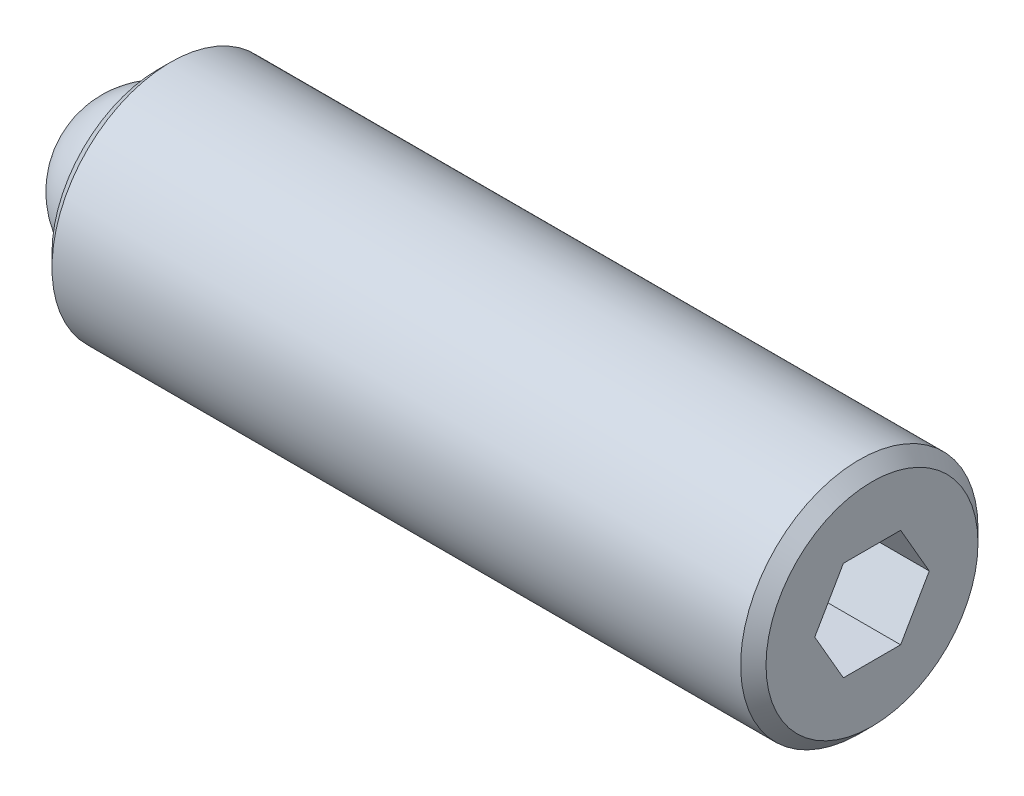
ISO-10303-21;
HEADER;
FILE_DESCRIPTION(('STEP AP214'),'2;1');
FILE_NAME('part.step','',(''),(''),'','','');
FILE_SCHEMA(('AUTOMOTIVE_DESIGN { 1 0 10303 214 1 1 1 1 }'));
ENDSEC;
DATA;
#1=APPLICATION_CONTEXT('core data for automotive mechanical design processes');
#2=APPLICATION_PROTOCOL_DEFINITION('international standard','automotive_design',2000,#1);
#3=PRODUCT_CONTEXT('',#1,'mechanical');
#4=PRODUCT('Part','Part','',(#3));
#5=PRODUCT_RELATED_PRODUCT_CATEGORY('part','',(#4));
#6=PRODUCT_DEFINITION_FORMATION('','',#4);
#7=PRODUCT_DEFINITION_CONTEXT('part definition',#1,'design');
#8=PRODUCT_DEFINITION('design','',#6,#7);
#9=PRODUCT_DEFINITION_SHAPE('','',#8);
#10=(LENGTH_UNIT() NAMED_UNIT(*) SI_UNIT(.MILLI.,.METRE.));
#11=(NAMED_UNIT(*) PLANE_ANGLE_UNIT() SI_UNIT($,.RADIAN.));
#12=(NAMED_UNIT(*) SI_UNIT($,.STERADIAN.) SOLID_ANGLE_UNIT());
#13=UNCERTAINTY_MEASURE_WITH_UNIT(LENGTH_MEASURE(1.E-05),#10,'distance_accuracy_value','');
#14=(GEOMETRIC_REPRESENTATION_CONTEXT(3) GLOBAL_UNCERTAINTY_ASSIGNED_CONTEXT((#13)) GLOBAL_UNIT_ASSIGNED_CONTEXT((#10,
#11,#12)) REPRESENTATION_CONTEXT('',''));
#15=CARTESIAN_POINT('',(0.,0.,0.));
#16=DIRECTION('',(0.,0.,1.));
#17=DIRECTION('',(1.,0.,0.));
#18=AXIS2_PLACEMENT_3D('',#15,#16,#17);
#19=CARTESIAN_POINT('',(0.,0.,0.));
#20=DIRECTION('',(0.,-1.,0.));
#21=DIRECTION('',(0.,0.,1.));
#22=AXIS2_PLACEMENT_3D('',#19,#20,#21);
#23=SPHERICAL_SURFACE('',#22,1.5875);
#24=CARTESIAN_POINT('',(0.,-1.5875,0.));
#25=VERTEX_POINT('',#24);
#26=VERTEX_LOOP('',#25);
#27=FACE_BOUND('',#26,.T.);
#28=ADVANCED_FACE('F41',(#27),#23,.T.);
#29=CLOSED_SHELL('',(#28));
#30=MANIFOLD_SOLID_BREP('B2',#29);
#31=CARTESIAN_POINT('',(14.2875,0.,0.));
#32=DIRECTION('',(-1.,0.,0.));
#33=DIRECTION('',(0.,0.,1.));
#34=AXIS2_PLACEMENT_3D('',#31,#32,#33);
#35=CYLINDRICAL_SURFACE('',#34,2.3749);
#36=CARTESIAN_POINT('',(14.0335,0.,0.));
#37=DIRECTION('',(1.,0.,0.));
#38=DIRECTION('',(0.,0.,-1.));
#39=AXIS2_PLACEMENT_3D('',#36,#37,#38);
#40=CIRCLE('',#39,2.3749);
#41=CARTESIAN_POINT('',(14.0335,0.,-2.3749));
#42=VERTEX_POINT('',#41);
#43=EDGE_CURVE('E39',#42,#42,#40,.F.);
#44=ORIENTED_EDGE('',*,*,#43,.T.);
#45=EDGE_LOOP('',(#44));
#46=FACE_BOUND('',#45,.T.);
#47=CARTESIAN_POINT('',(0.253999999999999,0.,0.));
#48=DIRECTION('',(1.,0.,0.));
#49=DIRECTION('',(0.,0.,-1.));
#50=AXIS2_PLACEMENT_3D('',#47,#48,#49);
#51=CIRCLE('',#50,2.3749);
#52=CARTESIAN_POINT('',(0.253999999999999,0.,-2.3749));
#53=VERTEX_POINT('',#52);
#54=EDGE_CURVE('E157',#53,#53,#51,.T.);
#55=ORIENTED_EDGE('',*,*,#54,.T.);
#56=EDGE_LOOP('',(#55));
#57=FACE_BOUND('',#56,.T.);
#58=ADVANCED_FACE('F54',(#46,#57),#35,.T.);
#59=CARTESIAN_POINT('',(14.2875,0.,0.));
#60=DIRECTION('',(1.,0.,0.));
#61=DIRECTION('',(0.,0.,-1.));
#62=AXIS2_PLACEMENT_3D('',#59,#60,#61);
#63=PLANE('',#62);
#64=DIRECTION('',(0.,0.866025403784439,-0.5));
#65=VECTOR('',#64,1.);
#66=CARTESIAN_POINT('',(14.2875,-0.992187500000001,-0.572839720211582));
#67=LINE('',#66,#65);
#68=CARTESIAN_POINT('',(14.2875,-0.992187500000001,-0.572839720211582));
#69=VERTEX_POINT('',#68);
#70=CARTESIAN_POINT('',(14.2875,0.,-1.14567944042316));
#71=VERTEX_POINT('',#70);
#72=EDGE_CURVE('E69',#69,#71,#67,.T.);
#73=ORIENTED_EDGE('',*,*,#72,.F.);
#74=DIRECTION('',(0.,0.,-1.));
#75=VECTOR('',#74,1.);
#76=CARTESIAN_POINT('',(14.2875,-0.992187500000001,0.572839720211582));
#77=LINE('',#76,#75);
#78=CARTESIAN_POINT('',(14.2875,-0.992187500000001,0.572839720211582));
#79=VERTEX_POINT('',#78);
#80=EDGE_CURVE('E153',#79,#69,#77,.T.);
#81=ORIENTED_EDGE('',*,*,#80,.F.);
#82=DIRECTION('',(0.,-0.866025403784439,-0.5));
#83=VECTOR('',#82,1.);
#84=CARTESIAN_POINT('',(14.2875,0.,1.14567944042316));
#85=LINE('',#84,#83);
#86=CARTESIAN_POINT('',(14.2875,0.,1.14567944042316));
#87=VERTEX_POINT('',#86);
#88=EDGE_CURVE('E151',#87,#79,#85,.T.);
#89=ORIENTED_EDGE('',*,*,#88,.F.);
#90=DIRECTION('',(0.,-0.866025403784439,0.5));
#91=VECTOR('',#90,1.);
#92=CARTESIAN_POINT('',(14.2875,0.992187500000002,0.572839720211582));
#93=LINE('',#92,#91);
#94=CARTESIAN_POINT('',(14.2875,0.992187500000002,0.572839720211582));
#95=VERTEX_POINT('',#94);
#96=EDGE_CURVE('E117',#95,#87,#93,.T.);
#97=ORIENTED_EDGE('',*,*,#96,.F.);
#98=DIRECTION('',(0.,0.,1.));
#99=VECTOR('',#98,1.);
#100=CARTESIAN_POINT('',(14.2875,0.992187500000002,-0.572839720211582));
#101=LINE('',#100,#99);
#102=CARTESIAN_POINT('',(14.2875,0.992187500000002,-0.572839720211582));
#103=VERTEX_POINT('',#102);
#104=EDGE_CURVE('E147',#103,#95,#101,.T.);
#105=ORIENTED_EDGE('',*,*,#104,.F.);
#106=DIRECTION('',(0.,0.866025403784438,0.5));
#107=VECTOR('',#106,1.);
#108=CARTESIAN_POINT('',(14.2875,0.,-1.14567944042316));
#109=LINE('',#108,#107);
#110=EDGE_CURVE('E143',#71,#103,#109,.T.);
#111=ORIENTED_EDGE('',*,*,#110,.F.);
#112=EDGE_LOOP('',(#73,#81,#89,#97,#105,#111));
#113=FACE_BOUND('',#112,.T.);
#114=CARTESIAN_POINT('',(14.2875,0.,0.));
#115=DIRECTION('',(1.,0.,0.));
#116=DIRECTION('',(0.,0.,-1.));
#117=AXIS2_PLACEMENT_3D('',#114,#115,#116);
#118=CIRCLE('',#117,2.1209);
#119=CARTESIAN_POINT('',(14.2875,0.,-2.1209));
#120=VERTEX_POINT('',#119);
#121=EDGE_CURVE('E62',#120,#120,#118,.T.);
#122=ORIENTED_EDGE('',*,*,#121,.T.);
#123=EDGE_LOOP('',(#122));
#124=FACE_BOUND('',#123,.T.);
#125=ADVANCED_FACE('F170',(#113,#124),#63,.T.);
#126=CARTESIAN_POINT('',(0.,0.,0.));
#127=DIRECTION('',(1.,0.,0.));
#128=DIRECTION('',(0.,0.,-1.));
#129=AXIS2_PLACEMENT_3D('',#126,#127,#128);
#130=PLANE('',#129);
#131=CARTESIAN_POINT('',(0.,0.,0.));
#132=DIRECTION('',(-1.,0.,0.));
#133=DIRECTION('',(0.,0.,1.));
#134=AXIS2_PLACEMENT_3D('',#131,#132,#133);
#135=CIRCLE('',#134,1.5875);
#136=CARTESIAN_POINT('',(0.,0.,1.5875));
#137=VERTEX_POINT('',#136);
#138=EDGE_CURVE('E225',#137,#137,#135,.T.);
#139=ORIENTED_EDGE('',*,*,#138,.F.);
#140=EDGE_LOOP('',(#139));
#141=FACE_BOUND('',#140,.T.);
#142=CARTESIAN_POINT('',(0.,0.,0.));
#143=DIRECTION('',(1.,0.,0.));
#144=DIRECTION('',(0.,0.,-1.));
#145=AXIS2_PLACEMENT_3D('',#142,#143,#144);
#146=CIRCLE('',#145,2.1209);
#147=CARTESIAN_POINT('',(0.,0.,-2.1209));
#148=VERTEX_POINT('',#147);
#149=EDGE_CURVE('E165',#148,#148,#146,.F.);
#150=ORIENTED_EDGE('',*,*,#149,.T.);
#151=EDGE_LOOP('',(#150));
#152=FACE_BOUND('',#151,.T.);
#153=ADVANCED_FACE('F182',(#141,#152),#130,.F.);
#154=CARTESIAN_POINT('',(0.253999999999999,0.,0.));
#155=DIRECTION('',(1.,0.,0.));
#156=DIRECTION('',(0.,0.,-1.));
#157=AXIS2_PLACEMENT_3D('',#154,#155,#156);
#158=CONICAL_SURFACE('',#157,2.3749,0.785398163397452);
#159=ORIENTED_EDGE('',*,*,#149,.F.);
#160=EDGE_LOOP('',(#159));
#161=FACE_BOUND('',#160,.T.);
#162=ORIENTED_EDGE('',*,*,#54,.F.);
#163=EDGE_LOOP('',(#162));
#164=FACE_BOUND('',#163,.T.);
#165=ADVANCED_FACE('F174',(#161,#164),#158,.T.);
#166=CARTESIAN_POINT('',(14.2875,0.,0.));
#167=DIRECTION('',(-1.,0.,0.));
#168=DIRECTION('',(0.,0.,1.));
#169=AXIS2_PLACEMENT_3D('',#166,#167,#168);
#170=CONICAL_SURFACE('',#169,2.1209,0.785398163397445);
#171=ORIENTED_EDGE('',*,*,#43,.F.);
#172=EDGE_LOOP('',(#171));
#173=FACE_BOUND('',#172,.T.);
#174=ORIENTED_EDGE('',*,*,#121,.F.);
#175=EDGE_LOOP('',(#174));
#176=FACE_BOUND('',#175,.T.);
#177=ADVANCED_FACE('F56',(#173,#176),#170,.T.);
#178=CARTESIAN_POINT('',(12.0015,-0.992187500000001,-0.572839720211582));
#179=DIRECTION('',(0.,-0.5,-0.866025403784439));
#180=DIRECTION('',(0.,0.866025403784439,-0.5));
#181=AXIS2_PLACEMENT_3D('',#178,#179,#180);
#182=PLANE('',#181);
#183=ORIENTED_EDGE('',*,*,#72,.T.);
#184=DIRECTION('',(1.,0.,0.));
#185=VECTOR('',#184,1.);
#186=CARTESIAN_POINT('',(12.0015,0.,-1.14567944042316));
#187=LINE('',#186,#185);
#188=CARTESIAN_POINT('',(12.0015,0.,-1.14567944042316));
#189=VERTEX_POINT('',#188);
#190=EDGE_CURVE('E99',#189,#71,#187,.T.);
#191=ORIENTED_EDGE('',*,*,#190,.F.);
#192=DIRECTION('',(0.,0.866025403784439,-0.5));
#193=VECTOR('',#192,1.);
#194=CARTESIAN_POINT('',(12.0015,-0.992187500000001,-0.572839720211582));
#195=LINE('',#194,#193);
#196=CARTESIAN_POINT('',(12.0015,-0.992187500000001,-0.572839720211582));
#197=VERTEX_POINT('',#196);
#198=EDGE_CURVE('E155',#197,#189,#195,.T.);
#199=ORIENTED_EDGE('',*,*,#198,.F.);
#200=DIRECTION('',(1.,0.,0.));
#201=VECTOR('',#200,1.);
#202=CARTESIAN_POINT('',(12.0015,-0.992187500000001,-0.572839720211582));
#203=LINE('',#202,#201);
#204=EDGE_CURVE('E77',#197,#69,#203,.T.);
#205=ORIENTED_EDGE('',*,*,#204,.T.);
#206=EDGE_LOOP('',(#183,#191,#199,#205));
#207=FACE_BOUND('',#206,.T.);
#208=ADVANCED_FACE('F173',(#207),#182,.F.);
#209=CARTESIAN_POINT('',(12.0015,-0.992187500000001,0.572839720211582));
#210=DIRECTION('',(0.,-1.,0.));
#211=DIRECTION('',(0.,0.,-1.));
#212=AXIS2_PLACEMENT_3D('',#209,#210,#211);
#213=PLANE('',#212);
#214=ORIENTED_EDGE('',*,*,#80,.T.);
#215=ORIENTED_EDGE('',*,*,#204,.F.);
#216=DIRECTION('',(0.,0.,-1.));
#217=VECTOR('',#216,1.);
#218=CARTESIAN_POINT('',(12.0015,-0.992187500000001,0.572839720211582));
#219=LINE('',#218,#217);
#220=CARTESIAN_POINT('',(12.0015,-0.992187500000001,0.572839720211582));
#221=VERTEX_POINT('',#220);
#222=EDGE_CURVE('E129',#221,#197,#219,.T.);
#223=ORIENTED_EDGE('',*,*,#222,.F.);
#224=DIRECTION('',(1.,0.,0.));
#225=VECTOR('',#224,1.);
#226=CARTESIAN_POINT('',(12.0015,-0.992187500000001,0.572839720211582));
#227=LINE('',#226,#225);
#228=EDGE_CURVE('E121',#221,#79,#227,.T.);
#229=ORIENTED_EDGE('',*,*,#228,.T.);
#230=EDGE_LOOP('',(#214,#215,#223,#229));
#231=FACE_BOUND('',#230,.T.);
#232=ADVANCED_FACE('F180',(#231),#213,.F.);
#233=CARTESIAN_POINT('',(12.0015,0.,1.14567944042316));
#234=DIRECTION('',(0.,-0.5,0.866025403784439));
#235=DIRECTION('',(0.,-0.866025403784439,-0.5));
#236=AXIS2_PLACEMENT_3D('',#233,#234,#235);
#237=PLANE('',#236);
#238=ORIENTED_EDGE('',*,*,#88,.T.);
#239=ORIENTED_EDGE('',*,*,#228,.F.);
#240=DIRECTION('',(0.,-0.866025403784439,-0.5));
#241=VECTOR('',#240,1.);
#242=CARTESIAN_POINT('',(12.0015,0.,1.14567944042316));
#243=LINE('',#242,#241);
#244=CARTESIAN_POINT('',(12.0015,0.,1.14567944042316));
#245=VERTEX_POINT('',#244);
#246=EDGE_CURVE('E125',#245,#221,#243,.T.);
#247=ORIENTED_EDGE('',*,*,#246,.F.);
#248=DIRECTION('',(1.,0.,0.));
#249=VECTOR('',#248,1.);
#250=CARTESIAN_POINT('',(12.0015,0.,1.14567944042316));
#251=LINE('',#250,#249);
#252=EDGE_CURVE('E110',#245,#87,#251,.T.);
#253=ORIENTED_EDGE('',*,*,#252,.T.);
#254=EDGE_LOOP('',(#238,#239,#247,#253));
#255=FACE_BOUND('',#254,.T.);
#256=ADVANCED_FACE('F126',(#255),#237,.F.);
#257=CARTESIAN_POINT('',(12.0015,0.992187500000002,0.572839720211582));
#258=DIRECTION('',(0.,0.5,0.866025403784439));
#259=DIRECTION('',(0.,-0.866025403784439,0.5));
#260=AXIS2_PLACEMENT_3D('',#257,#258,#259);
#261=PLANE('',#260);
#262=ORIENTED_EDGE('',*,*,#96,.T.);
#263=ORIENTED_EDGE('',*,*,#252,.F.);
#264=DIRECTION('',(0.,-0.866025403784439,0.5));
#265=VECTOR('',#264,1.);
#266=CARTESIAN_POINT('',(12.0015,0.992187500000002,0.572839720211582));
#267=LINE('',#266,#265);
#268=CARTESIAN_POINT('',(12.0015,0.992187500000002,0.572839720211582));
#269=VERTEX_POINT('',#268);
#270=EDGE_CURVE('E114',#269,#245,#267,.T.);
#271=ORIENTED_EDGE('',*,*,#270,.F.);
#272=DIRECTION('',(1.,0.,0.));
#273=VECTOR('',#272,1.);
#274=CARTESIAN_POINT('',(12.0015,0.992187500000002,0.572839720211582));
#275=LINE('',#274,#273);
#276=EDGE_CURVE('E122',#269,#95,#275,.T.);
#277=ORIENTED_EDGE('',*,*,#276,.T.);
#278=EDGE_LOOP('',(#262,#263,#271,#277));
#279=FACE_BOUND('',#278,.T.);
#280=ADVANCED_FACE('F112',(#279),#261,.F.);
#281=CARTESIAN_POINT('',(12.0015,0.992187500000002,-0.572839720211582));
#282=DIRECTION('',(0.,1.,0.));
#283=DIRECTION('',(0.,0.,1.));
#284=AXIS2_PLACEMENT_3D('',#281,#282,#283);
#285=PLANE('',#284);
#286=ORIENTED_EDGE('',*,*,#104,.T.);
#287=ORIENTED_EDGE('',*,*,#276,.F.);
#288=DIRECTION('',(0.,0.,1.));
#289=VECTOR('',#288,1.);
#290=CARTESIAN_POINT('',(12.0015,0.992187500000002,-0.572839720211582));
#291=LINE('',#290,#289);
#292=CARTESIAN_POINT('',(12.0015,0.992187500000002,-0.572839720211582));
#293=VERTEX_POINT('',#292);
#294=EDGE_CURVE('E135',#293,#269,#291,.T.);
#295=ORIENTED_EDGE('',*,*,#294,.F.);
#296=DIRECTION('',(1.,0.,0.));
#297=VECTOR('',#296,1.);
#298=CARTESIAN_POINT('',(12.0015,0.992187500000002,-0.572839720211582));
#299=LINE('',#298,#297);
#300=EDGE_CURVE('E160',#293,#103,#299,.T.);
#301=ORIENTED_EDGE('',*,*,#300,.T.);
#302=EDGE_LOOP('',(#286,#287,#295,#301));
#303=FACE_BOUND('',#302,.T.);
#304=ADVANCED_FACE('F201',(#303),#285,.F.);
#305=CARTESIAN_POINT('',(12.0015,0.,-1.14567944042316));
#306=DIRECTION('',(0.,0.5,-0.866025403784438));
#307=DIRECTION('',(0.,0.866025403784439,0.5));
#308=AXIS2_PLACEMENT_3D('',#305,#306,#307);
#309=PLANE('',#308);
#310=ORIENTED_EDGE('',*,*,#110,.T.);
#311=ORIENTED_EDGE('',*,*,#300,.F.);
#312=DIRECTION('',(0.,0.866025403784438,0.5));
#313=VECTOR('',#312,1.);
#314=CARTESIAN_POINT('',(12.0015,0.,-1.14567944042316));
#315=LINE('',#314,#313);
#316=EDGE_CURVE('E137',#189,#293,#315,.T.);
#317=ORIENTED_EDGE('',*,*,#316,.F.);
#318=ORIENTED_EDGE('',*,*,#190,.T.);
#319=EDGE_LOOP('',(#310,#311,#317,#318));
#320=FACE_BOUND('',#319,.T.);
#321=ADVANCED_FACE('F198',(#320),#309,.F.);
#322=CARTESIAN_POINT('',(12.0015,0.,0.));
#323=DIRECTION('',(1.,0.,0.));
#324=DIRECTION('',(0.,0.,-1.));
#325=AXIS2_PLACEMENT_3D('',#322,#323,#324);
#326=PLANE('',#325);
#327=ORIENTED_EDGE('',*,*,#198,.T.);
#328=ORIENTED_EDGE('',*,*,#316,.T.);
#329=ORIENTED_EDGE('',*,*,#294,.T.);
#330=ORIENTED_EDGE('',*,*,#270,.T.);
#331=ORIENTED_EDGE('',*,*,#246,.T.);
#332=ORIENTED_EDGE('',*,*,#222,.T.);
#333=EDGE_LOOP('',(#327,#328,#329,#330,#331,#332));
#334=FACE_BOUND('',#333,.T.);
#335=ADVANCED_FACE('F132',(#334),#326,.T.);
#336=CARTESIAN_POINT('',(1.5875,0.,0.));
#337=DIRECTION('',(-1.,0.,0.));
#338=DIRECTION('',(0.,0.,1.));
#339=AXIS2_PLACEMENT_3D('',#336,#337,#338);
#340=CYLINDRICAL_SURFACE('',#339,1.5875);
#341=CARTESIAN_POINT('',(1.5875,0.,0.));
#342=DIRECTION('',(-1.,0.,0.));
#343=DIRECTION('',(0.,0.,1.));
#344=AXIS2_PLACEMENT_3D('',#341,#342,#343);
#345=CIRCLE('',#344,1.5875);
#346=CARTESIAN_POINT('',(1.5875,0.,1.5875));
#347=VERTEX_POINT('',#346);
#348=EDGE_CURVE('E144',#347,#347,#345,.T.);
#349=ORIENTED_EDGE('',*,*,#348,.F.);
#350=EDGE_LOOP('',(#349));
#351=FACE_BOUND('',#350,.T.);
#352=ORIENTED_EDGE('',*,*,#138,.T.);
#353=EDGE_LOOP('',(#352));
#354=FACE_BOUND('',#353,.T.);
#355=ADVANCED_FACE('F214',(#351,#354),#340,.F.);
#356=CARTESIAN_POINT('',(1.5875,0.,0.));
#357=DIRECTION('',(-1.,0.,0.));
#358=DIRECTION('',(0.,0.,1.));
#359=AXIS2_PLACEMENT_3D('',#356,#357,#358);
#360=PLANE('',#359);
#361=ORIENTED_EDGE('',*,*,#348,.T.);
#362=EDGE_LOOP('',(#361));
#363=FACE_BOUND('',#362,.T.);
#364=ADVANCED_FACE('F217',(#363),#360,.T.);
#365=CLOSED_SHELL('',(#58,#125,#153,#165,#177,#208,#232,#256,#280,#304,#321,#335,#355,#364));
#366=MANIFOLD_SOLID_BREP('B6',#365);
#367=ADVANCED_BREP_SHAPE_REPRESENTATION('',(#18,#30,#366),#14);
#368=SHAPE_DEFINITION_REPRESENTATION(#9,#367);
ENDSEC;
END-ISO-10303-21;
